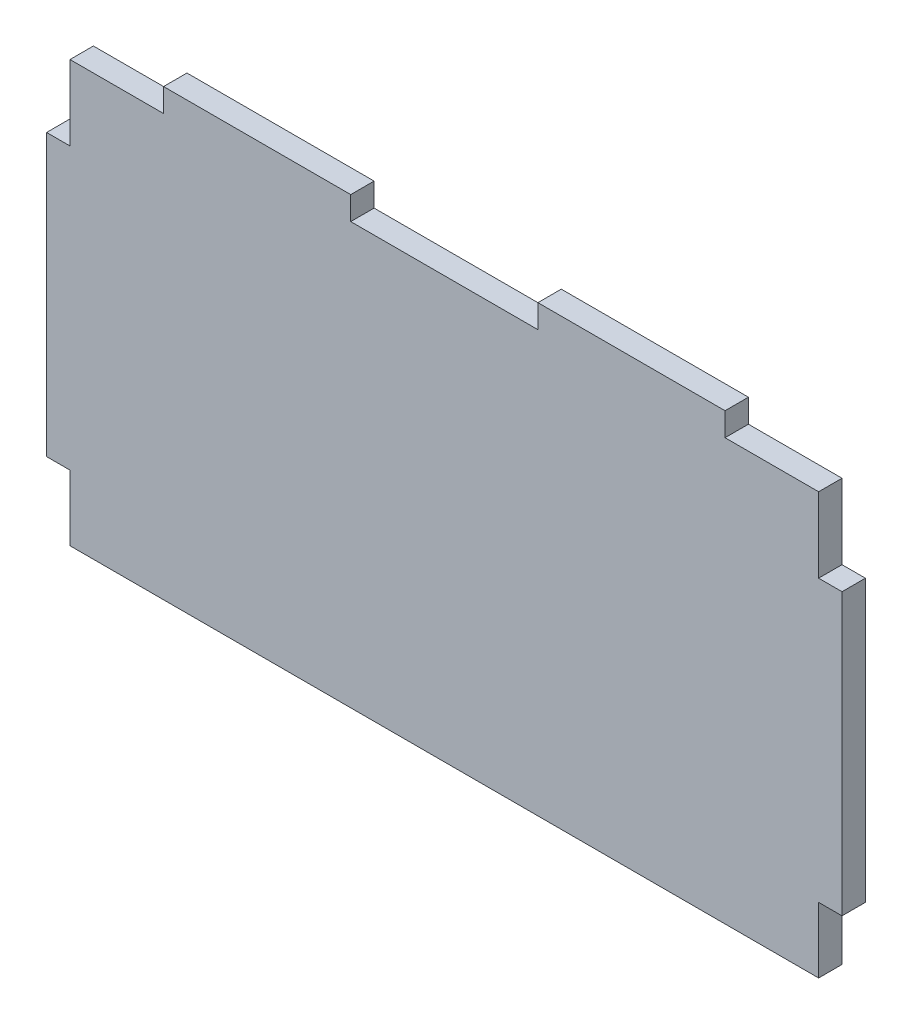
from build123d import *

# Parameters (mm, degrees)
SKETCH1_W           = 101.6
SKETCH1_H           = 57.15
BOSS_EXTRUDE1_DEPTH = 3.175
SKETCH2_W           = 3.175
SKETCH2_H           = 38.1
BOSS_EXTRUDE2_DEPTH = 3.175
SKETCH3_W           = 3.175
SKETCH3_H           = 38.1
BOSS_EXTRUDE3_DEPTH = 3.175
SKETCH4_W           = 25.4
SKETCH4_H           = 3.175
BOSS_EXTRUDE5_DEPTH = 3.175


with BuildPart() as part:
    # Sketch1 → Boss-Extrude1 (new body)
    with BuildSketch(Plane.XY):
        Rectangle(SKETCH1_W, SKETCH1_H)
    extrude(amount=BOSS_EXTRUDE1_DEPTH)

    # Sketch2 → Boss-Extrude2 (add)
    with BuildSketch(Plane(origin=(50.8, 0, 0), x_dir=(0, 0, -1), z_dir=(1, 0, 0))):
        with Locations((-1.5875, -0.635)):
            Rectangle(SKETCH2_W, SKETCH2_H)
    extrude(amount=BOSS_EXTRUDE2_DEPTH)

    # Sketch3 → Boss-Extrude3 (add)
    with BuildSketch(Plane.ZY.offset(50.8)):
        with Locations((1.5875, -0.635)):
            Rectangle(SKETCH3_W, SKETCH3_H)
    extrude(amount=BOSS_EXTRUDE3_DEPTH)

    # Sketch4 → Boss-Extrude5 (add)
    with BuildSketch(Plane(origin=(0, 28.575, 0), x_dir=(1, 0, 0), z_dir=(0, 1, 0))):
        with Locations((-25.4, -1.5875)):
            Rectangle(SKETCH4_W, SKETCH4_H)
        with Locations((25.4, -1.5875)):
            Rectangle(SKETCH4_W, SKETCH4_H)
    extrude(amount=BOSS_EXTRUDE5_DEPTH)


solid = part.part
